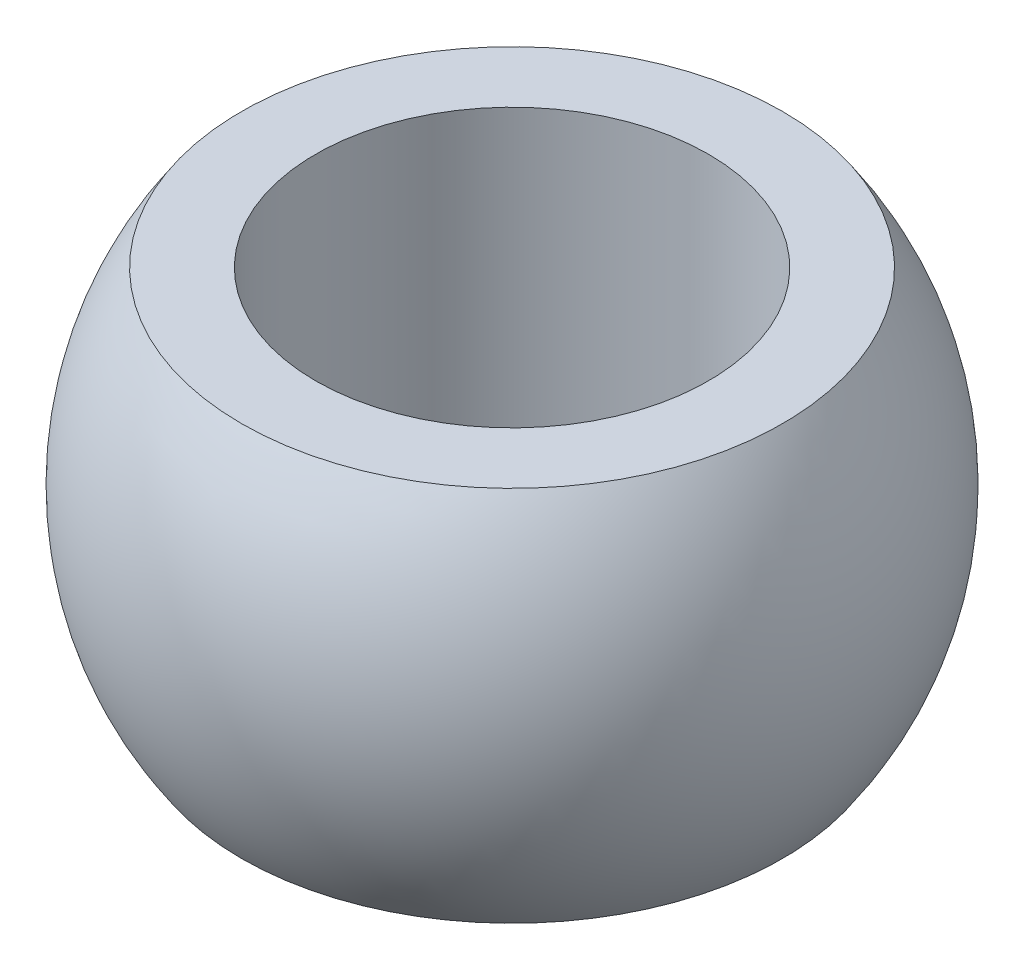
ISO-10303-21;
HEADER;
FILE_DESCRIPTION(('STEP AP214'),'2;1');
FILE_NAME('part.step','',(''),(''),'','','');
FILE_SCHEMA(('AUTOMOTIVE_DESIGN { 1 0 10303 214 1 1 1 1 }'));
ENDSEC;
DATA;
#1=APPLICATION_CONTEXT('core data for automotive mechanical design processes');
#2=APPLICATION_PROTOCOL_DEFINITION('international standard','automotive_design',2000,#1);
#3=PRODUCT_CONTEXT('',#1,'mechanical');
#4=PRODUCT('Part','Part','',(#3));
#5=PRODUCT_RELATED_PRODUCT_CATEGORY('part','',(#4));
#6=PRODUCT_DEFINITION_FORMATION('','',#4);
#7=PRODUCT_DEFINITION_CONTEXT('part definition',#1,'design');
#8=PRODUCT_DEFINITION('design','',#6,#7);
#9=PRODUCT_DEFINITION_SHAPE('','',#8);
#10=(LENGTH_UNIT() NAMED_UNIT(*) SI_UNIT(.MILLI.,.METRE.));
#11=(NAMED_UNIT(*) PLANE_ANGLE_UNIT() SI_UNIT($,.RADIAN.));
#12=(NAMED_UNIT(*) SI_UNIT($,.STERADIAN.) SOLID_ANGLE_UNIT());
#13=UNCERTAINTY_MEASURE_WITH_UNIT(LENGTH_MEASURE(1.E-05),#10,'distance_accuracy_value','');
#14=(GEOMETRIC_REPRESENTATION_CONTEXT(3) GLOBAL_UNCERTAINTY_ASSIGNED_CONTEXT((#13)) GLOBAL_UNIT_ASSIGNED_CONTEXT((#10,
#11,#12)) REPRESENTATION_CONTEXT('',''));
#15=CARTESIAN_POINT('',(0.,0.,0.));
#16=DIRECTION('',(0.,0.,1.));
#17=DIRECTION('',(1.,0.,0.));
#18=AXIS2_PLACEMENT_3D('',#15,#16,#17);
#19=CARTESIAN_POINT('',(0.,0.,0.));
#20=DIRECTION('',(0.,0.,1.));
#21=DIRECTION('',(1.,0.,0.));
#22=AXIS2_PLACEMENT_3D('',#19,#20,#21);
#23=SPHERICAL_SURFACE('',#22,24.5);
#24=CARTESIAN_POINT('',(0.,0.,0.));
#25=DIRECTION('',(0.,1.,0.));
#26=DIRECTION('',(0.,0.,1.));
#27=AXIS2_PLACEMENT_3D('',#24,#25,#26);
#28=SPHERICAL_SURFACE('',#27,24.5);
#29=CARTESIAN_POINT('',(0.,-14.,0.));
#30=DIRECTION('',(0.,1.,0.));
#31=DIRECTION('',(0.,0.,1.));
#32=AXIS2_PLACEMENT_3D('',#29,#30,#31);
#33=CIRCLE('',#32,20.1059692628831);
#34=CARTESIAN_POINT('',(0.,-14.,20.1059692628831));
#35=VERTEX_POINT('',#34);
#36=EDGE_CURVE('E10',#35,#35,#33,.T.);
#37=ORIENTED_EDGE('',*,*,#36,.T.);
#38=EDGE_LOOP('',(#37));
#39=FACE_BOUND('',#38,.T.);
#40=CARTESIAN_POINT('',(0.,14.,0.));
#41=DIRECTION('',(0.,1.,0.));
#42=DIRECTION('',(0.,0.,1.));
#43=AXIS2_PLACEMENT_3D('',#40,#41,#42);
#44=CIRCLE('',#43,20.1059692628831);
#45=CARTESIAN_POINT('',(0.,14.,20.1059692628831));
#46=VERTEX_POINT('',#45);
#47=EDGE_CURVE('E45',#46,#46,#44,.T.);
#48=ORIENTED_EDGE('',*,*,#47,.F.);
#49=EDGE_LOOP('',(#48));
#50=FACE_BOUND('',#49,.T.);
#51=ADVANCED_FACE('F31',(#39,#50),#28,.T.);
#52=CARTESIAN_POINT('',(-20.1059692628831,-14.,0.));
#53=DIRECTION('',(0.,-1.,0.));
#54=DIRECTION('',(0.,0.,-1.));
#55=AXIS2_PLACEMENT_3D('',#52,#53,#54);
#56=PLANE('',#55);
#57=CARTESIAN_POINT('',(0.,-14.,0.));
#58=DIRECTION('',(0.,1.,0.));
#59=DIRECTION('',(0.,0.,1.));
#60=AXIS2_PLACEMENT_3D('',#57,#58,#59);
#61=CIRCLE('',#60,14.6);
#62=CARTESIAN_POINT('',(0.,-14.,14.6));
#63=VERTEX_POINT('',#62);
#64=EDGE_CURVE('E37',#63,#63,#61,.T.);
#65=ORIENTED_EDGE('',*,*,#64,.T.);
#66=EDGE_LOOP('',(#65));
#67=FACE_BOUND('',#66,.T.);
#68=ORIENTED_EDGE('',*,*,#36,.F.);
#69=EDGE_LOOP('',(#68));
#70=FACE_BOUND('',#69,.T.);
#71=ADVANCED_FACE('F54',(#67,#70),#56,.T.);
#72=CARTESIAN_POINT('',(0.,20.7018317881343,0.));
#73=DIRECTION('',(0.,1.,0.));
#74=DIRECTION('',(0.,0.,1.));
#75=AXIS2_PLACEMENT_3D('',#72,#73,#74);
#76=CYLINDRICAL_SURFACE('',#75,14.6);
#77=ORIENTED_EDGE('',*,*,#64,.F.);
#78=EDGE_LOOP('',(#77));
#79=FACE_BOUND('',#78,.T.);
#80=CARTESIAN_POINT('',(0.,14.,0.));
#81=DIRECTION('',(0.,1.,0.));
#82=DIRECTION('',(0.,0.,1.));
#83=AXIS2_PLACEMENT_3D('',#80,#81,#82);
#84=CIRCLE('',#83,14.6);
#85=CARTESIAN_POINT('',(0.,14.,14.6));
#86=VERTEX_POINT('',#85);
#87=EDGE_CURVE('E41',#86,#86,#84,.T.);
#88=ORIENTED_EDGE('',*,*,#87,.T.);
#89=EDGE_LOOP('',(#88));
#90=FACE_BOUND('',#89,.T.);
#91=ADVANCED_FACE('F58',(#79,#90),#76,.F.);
#92=CARTESIAN_POINT('',(-20.1059692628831,14.,0.));
#93=DIRECTION('',(0.,-1.,0.));
#94=DIRECTION('',(0.,0.,-1.));
#95=AXIS2_PLACEMENT_3D('',#92,#93,#94);
#96=PLANE('',#95);
#97=ORIENTED_EDGE('',*,*,#87,.F.);
#98=EDGE_LOOP('',(#97));
#99=FACE_BOUND('',#98,.T.);
#100=ORIENTED_EDGE('',*,*,#47,.T.);
#101=EDGE_LOOP('',(#100));
#102=FACE_BOUND('',#101,.T.);
#103=ADVANCED_FACE('F51',(#99,#102),#96,.F.);
#104=CLOSED_SHELL('',(#51,#71,#91,#103));
#105=MANIFOLD_SOLID_BREP('B2',#104);
#106=ADVANCED_BREP_SHAPE_REPRESENTATION('',(#18,#105),#14);
#107=SHAPE_DEFINITION_REPRESENTATION(#9,#106);
ENDSEC;
END-ISO-10303-21;
